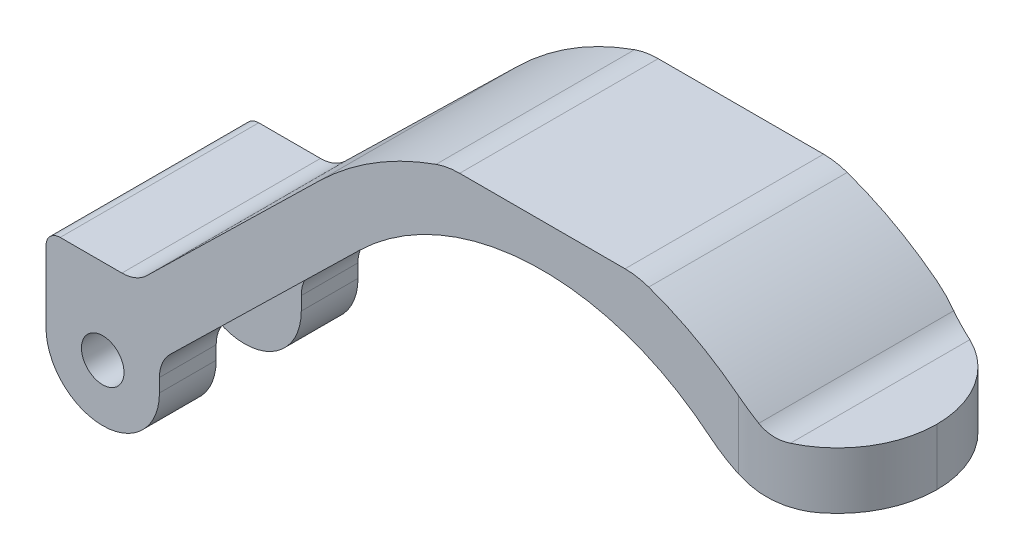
ISO-10303-21;
HEADER;
FILE_DESCRIPTION(('STEP AP214'),'2;1');
FILE_NAME('part.step','',(''),(''),'','','');
FILE_SCHEMA(('AUTOMOTIVE_DESIGN { 1 0 10303 214 1 1 1 1 }'));
ENDSEC;
DATA;
#1=APPLICATION_CONTEXT('core data for automotive mechanical design processes');
#2=APPLICATION_PROTOCOL_DEFINITION('international standard','automotive_design',2000,#1);
#3=PRODUCT_CONTEXT('',#1,'mechanical');
#4=PRODUCT('Part','Part','',(#3));
#5=PRODUCT_RELATED_PRODUCT_CATEGORY('part','',(#4));
#6=PRODUCT_DEFINITION_FORMATION('','',#4);
#7=PRODUCT_DEFINITION_CONTEXT('part definition',#1,'design');
#8=PRODUCT_DEFINITION('design','',#6,#7);
#9=PRODUCT_DEFINITION_SHAPE('','',#8);
#10=(LENGTH_UNIT() NAMED_UNIT(*) SI_UNIT(.MILLI.,.METRE.));
#11=(NAMED_UNIT(*) PLANE_ANGLE_UNIT() SI_UNIT($,.RADIAN.));
#12=(NAMED_UNIT(*) SI_UNIT($,.STERADIAN.) SOLID_ANGLE_UNIT());
#13=UNCERTAINTY_MEASURE_WITH_UNIT(LENGTH_MEASURE(1.E-05),#10,'distance_accuracy_value','');
#14=(GEOMETRIC_REPRESENTATION_CONTEXT(3) GLOBAL_UNCERTAINTY_ASSIGNED_CONTEXT((#13)) GLOBAL_UNIT_ASSIGNED_CONTEXT((#10,
#11,#12)) REPRESENTATION_CONTEXT('',''));
#15=CARTESIAN_POINT('',(0.,0.,0.));
#16=DIRECTION('',(0.,0.,1.));
#17=DIRECTION('',(1.,0.,0.));
#18=AXIS2_PLACEMENT_3D('',#15,#16,#17);
#19=CARTESIAN_POINT('',(0.,0.,28.));
#20=DIRECTION('',(0.,0.,-1.));
#21=DIRECTION('',(-1.,0.,0.));
#22=AXIS2_PLACEMENT_3D('',#19,#20,#21);
#23=CYLINDRICAL_SURFACE('',#22,45.);
#24=CARTESIAN_POINT('',(0.,0.,28.));
#25=DIRECTION('',(0.,0.,1.));
#26=DIRECTION('',(1.,0.,0.));
#27=AXIS2_PLACEMENT_3D('',#24,#25,#26);
#28=CIRCLE('',#27,45.);
#29=CARTESIAN_POINT('',(-14.9938763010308,42.4285714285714,28.));
#30=VERTEX_POINT('',#29);
#31=CARTESIAN_POINT('',(-31.4297251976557,32.2051606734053,28.));
#32=VERTEX_POINT('',#31);
#33=EDGE_CURVE('E262',#30,#32,#28,.T.);
#34=ORIENTED_EDGE('',*,*,#33,.F.);
#35=DIRECTION('',(0.,0.,-1.));
#36=VECTOR('',#35,1.);
#37=CARTESIAN_POINT('',(-14.9938763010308,42.4285714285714,28.));
#38=LINE('',#37,#36);
#39=CARTESIAN_POINT('',(-14.9938763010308,42.4285714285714,0.));
#40=VERTEX_POINT('',#39);
#41=EDGE_CURVE('E11',#30,#40,#38,.T.);
#42=ORIENTED_EDGE('',*,*,#41,.T.);
#43=CARTESIAN_POINT('',(0.,0.,0.));
#44=DIRECTION('',(0.,0.,1.));
#45=DIRECTION('',(1.,0.,0.));
#46=AXIS2_PLACEMENT_3D('',#43,#44,#45);
#47=CIRCLE('',#46,45.);
#48=CARTESIAN_POINT('',(-31.4297251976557,32.2051606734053,0.));
#49=VERTEX_POINT('',#48);
#50=EDGE_CURVE('E285',#40,#49,#47,.T.);
#51=ORIENTED_EDGE('',*,*,#50,.T.);
#52=DIRECTION('',(0.,0.,-1.));
#53=VECTOR('',#52,1.);
#54=CARTESIAN_POINT('',(-31.4297251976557,32.2051606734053,28.));
#55=LINE('',#54,#53);
#56=EDGE_CURVE('E313',#32,#49,#55,.T.);
#57=ORIENTED_EDGE('',*,*,#56,.F.);
#58=EDGE_LOOP('',(#34,#42,#51,#57));
#59=FACE_BOUND('',#58,.T.);
#60=ADVANCED_FACE('F32',(#59),#23,.T.);
#61=CARTESIAN_POINT('',(-62.,-5.,28.));
#62=DIRECTION('',(0.,0.,-1.));
#63=DIRECTION('',(-1.,0.,0.));
#64=AXIS2_PLACEMENT_3D('',#61,#62,#63);
#65=CYLINDRICAL_SURFACE('',#64,8.00000000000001);
#66=DIRECTION('',(0.,0.,-1.));
#67=VECTOR('',#66,1.);
#68=CARTESIAN_POINT('',(-70.,-5.,28.));
#69=LINE('',#68,#67);
#70=CARTESIAN_POINT('',(-70.,-5.,28.));
#71=VERTEX_POINT('',#70);
#72=CARTESIAN_POINT('',(-70.,-4.99999999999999,20.));
#73=VERTEX_POINT('',#72);
#74=EDGE_CURVE('E311',#71,#73,#69,.T.);
#75=ORIENTED_EDGE('',*,*,#74,.T.);
#76=CARTESIAN_POINT('',(-62.,-5.,20.));
#77=DIRECTION('',(0.,0.,1.));
#78=DIRECTION('',(1.,0.,0.));
#79=AXIS2_PLACEMENT_3D('',#76,#77,#78);
#80=CIRCLE('',#79,8.00000000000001);
#81=CARTESIAN_POINT('',(-54.,-5.,20.));
#82=VERTEX_POINT('',#81);
#83=EDGE_CURVE('E236',#73,#82,#80,.T.);
#84=ORIENTED_EDGE('',*,*,#83,.T.);
#85=DIRECTION('',(0.,0.,-1.));
#86=VECTOR('',#85,1.);
#87=CARTESIAN_POINT('',(-54.,-5.,28.));
#88=LINE('',#87,#86);
#89=CARTESIAN_POINT('',(-54.,-5.,28.));
#90=VERTEX_POINT('',#89);
#91=EDGE_CURVE('E307',#90,#82,#88,.T.);
#92=ORIENTED_EDGE('',*,*,#91,.F.);
#93=CARTESIAN_POINT('',(-62.,-5.,28.));
#94=DIRECTION('',(0.,0.,1.));
#95=DIRECTION('',(-1.,0.,0.));
#96=AXIS2_PLACEMENT_3D('',#93,#94,#95);
#97=CIRCLE('',#96,8.00000000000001);
#98=EDGE_CURVE('E275',#71,#90,#97,.T.);
#99=ORIENTED_EDGE('',*,*,#98,.F.);
#100=EDGE_LOOP('',(#75,#84,#92,#99));
#101=FACE_BOUND('',#100,.T.);
#102=ADVANCED_FACE('F601',(#101),#65,.T.);
#103=CARTESIAN_POINT('',(-54.,-0.999999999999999,28.));
#104=DIRECTION('',(-1.,0.,0.));
#105=DIRECTION('',(0.,-1.,0.));
#106=AXIS2_PLACEMENT_3D('',#103,#104,#105);
#107=PLANE('',#106);
#108=DIRECTION('',(0.,1.,0.));
#109=VECTOR('',#108,1.);
#110=CARTESIAN_POINT('',(-54.,-0.999999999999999,0.));
#111=LINE('',#110,#109);
#112=CARTESIAN_POINT('',(-54.,-5.,0.));
#113=VERTEX_POINT('',#112);
#114=CARTESIAN_POINT('',(-54.,-3.1068478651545,0.));
#115=VERTEX_POINT('',#114);
#116=EDGE_CURVE('E300',#113,#115,#111,.T.);
#117=ORIENTED_EDGE('',*,*,#116,.T.);
#118=DIRECTION('',(0.,0.,-1.));
#119=VECTOR('',#118,1.);
#120=CARTESIAN_POINT('',(-54.,-3.1068478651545,8.));
#121=LINE('',#120,#119);
#122=CARTESIAN_POINT('',(-54.,-3.1068478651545,8.));
#123=VERTEX_POINT('',#122);
#124=EDGE_CURVE('E427',#115,#123,#121,.F.);
#125=ORIENTED_EDGE('',*,*,#124,.T.);
#126=DIRECTION('',(0.,-1.,0.));
#127=VECTOR('',#126,1.);
#128=CARTESIAN_POINT('',(-54.,-0.999999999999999,8.));
#129=LINE('',#128,#127);
#130=CARTESIAN_POINT('',(-54.,-5.,8.));
#131=VERTEX_POINT('',#130);
#132=EDGE_CURVE('E254',#123,#131,#129,.T.);
#133=ORIENTED_EDGE('',*,*,#132,.T.);
#134=EDGE_CURVE('E306',#131,#113,#88,.T.);
#135=ORIENTED_EDGE('',*,*,#134,.T.);
#136=EDGE_LOOP('',(#117,#125,#133,#135));
#137=FACE_BOUND('',#136,.T.);
#138=ADVANCED_FACE('F365',(#137),#107,.F.);
#139=CARTESIAN_POINT('',(0.,0.,28.));
#140=DIRECTION('',(0.,0.,-1.));
#141=DIRECTION('',(-1.,0.,0.));
#142=AXIS2_PLACEMENT_3D('',#139,#140,#141);
#143=CYLINDRICAL_SURFACE('',#142,37.);
#144=CARTESIAN_POINT('',(0.,0.,0.));
#145=DIRECTION('',(0.,0.,-1.));
#146=DIRECTION('',(1.,0.,0.));
#147=AXIS2_PLACEMENT_3D('',#144,#145,#146);
#148=CIRCLE('',#147,37.);
#149=CARTESIAN_POINT('',(-25.8422184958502,26.479798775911,0.));
#150=VERTEX_POINT('',#149);
#151=CARTESIAN_POINT('',(23.5211868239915,28.5614035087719,0.));
#152=VERTEX_POINT('',#151);
#153=EDGE_CURVE('E258',#150,#152,#148,.T.);
#154=ORIENTED_EDGE('',*,*,#153,.T.);
#155=DIRECTION('',(0.,0.,-1.));
#156=VECTOR('',#155,1.);
#157=CARTESIAN_POINT('',(23.5211868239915,28.5614035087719,28.));
#158=LINE('',#157,#156);
#159=CARTESIAN_POINT('',(23.5211868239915,28.5614035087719,28.));
#160=VERTEX_POINT('',#159);
#161=EDGE_CURVE('E536',#152,#160,#158,.F.);
#162=ORIENTED_EDGE('',*,*,#161,.T.);
#163=CARTESIAN_POINT('',(0.,0.,28.));
#164=DIRECTION('',(0.,0.,-1.));
#165=DIRECTION('',(1.,0.,0.));
#166=AXIS2_PLACEMENT_3D('',#163,#164,#165);
#167=CIRCLE('',#166,37.);
#168=CARTESIAN_POINT('',(-25.8422184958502,26.479798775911,28.));
#169=VERTEX_POINT('',#168);
#170=EDGE_CURVE('E259',#169,#160,#167,.T.);
#171=ORIENTED_EDGE('',*,*,#170,.F.);
#172=DIRECTION('',(0.,0.,-1.));
#173=VECTOR('',#172,1.);
#174=CARTESIAN_POINT('',(-25.8422184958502,26.479798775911,28.));
#175=LINE('',#174,#173);
#176=EDGE_CURVE('E282',#169,#150,#175,.T.);
#177=ORIENTED_EDGE('',*,*,#176,.T.);
#178=EDGE_LOOP('',(#154,#162,#171,#177));
#179=FACE_BOUND('',#178,.T.);
#180=ADVANCED_FACE('F362',(#179),#143,.F.);
#181=CARTESIAN_POINT('',(28.1602556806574,24.,28.));
#182=DIRECTION('',(0.,1.,0.));
#183=DIRECTION('',(0.,0.,1.));
#184=AXIS2_PLACEMENT_3D('',#181,#182,#183);
#185=PLANE('',#184);
#186=CARTESIAN_POINT('',(27.6385840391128,24.,14.));
#187=DIRECTION('',(0.,1.,0.));
#188=DIRECTION('',(0.,0.,1.));
#189=AXIS2_PLACEMENT_3D('',#186,#187,#188);
#190=CIRCLE('',#189,14.);
#191=CARTESIAN_POINT('',(41.6385840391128,24.,14.));
#192=VERTEX_POINT('',#191);
#193=CARTESIAN_POINT('',(36.2353418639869,24.,25.0496947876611));
#194=VERTEX_POINT('',#193);
#195=EDGE_CURVE('E550',#192,#194,#190,.F.);
#196=ORIENTED_EDGE('',*,*,#195,.T.);
#197=DIRECTION('',(0.,0.,-1.));
#198=VECTOR('',#197,1.);
#199=CARTESIAN_POINT('',(36.2353418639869,24.,28.));
#200=LINE('',#199,#198);
#201=CARTESIAN_POINT('',(36.2353418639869,24.,2.9503052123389));
#202=VERTEX_POINT('',#201);
#203=EDGE_CURVE('E384',#194,#202,#200,.T.);
#204=ORIENTED_EDGE('',*,*,#203,.T.);
#205=CARTESIAN_POINT('',(27.6385840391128,24.,14.));
#206=DIRECTION('',(0.,1.,0.));
#207=DIRECTION('',(0.,0.,1.));
#208=AXIS2_PLACEMENT_3D('',#205,#206,#207);
#209=CIRCLE('',#208,14.);
#210=EDGE_CURVE('E547',#202,#192,#209,.F.);
#211=ORIENTED_EDGE('',*,*,#210,.T.);
#212=EDGE_LOOP('',(#196,#204,#211));
#213=FACE_BOUND('',#212,.T.);
#214=ADVANCED_FACE('F358',(#213),#185,.F.);
#215=CARTESIAN_POINT('',(41.6385840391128,32.,28.));
#216=DIRECTION('',(0.,-1.,0.));
#217=DIRECTION('',(0.,0.,-1.));
#218=AXIS2_PLACEMENT_3D('',#215,#216,#217);
#219=PLANE('',#218);
#220=CARTESIAN_POINT('',(27.6385840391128,32.,14.));
#221=DIRECTION('',(0.,-1.,0.));
#222=DIRECTION('',(0.,0.,-1.));
#223=AXIS2_PLACEMENT_3D('',#220,#221,#222);
#224=CIRCLE('',#223,14.);
#225=CARTESIAN_POINT('',(41.6385840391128,32.,14.));
#226=VERTEX_POINT('',#225);
#227=CARTESIAN_POINT('',(33.6303434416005,32.,1.34698378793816));
#228=VERTEX_POINT('',#227);
#229=EDGE_CURVE('E557',#226,#228,#224,.F.);
#230=ORIENTED_EDGE('',*,*,#229,.T.);
#231=DIRECTION('',(0.,0.,1.));
#232=VECTOR('',#231,1.);
#233=CARTESIAN_POINT('',(33.6303434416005,32.,27.4164078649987));
#234=LINE('',#233,#232);
#235=CARTESIAN_POINT('',(33.6303434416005,32.,26.6530162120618));
#236=VERTEX_POINT('',#235);
#237=EDGE_CURVE('E569',#228,#236,#234,.T.);
#238=ORIENTED_EDGE('',*,*,#237,.T.);
#239=CARTESIAN_POINT('',(27.6385840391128,32.,14.));
#240=DIRECTION('',(0.,-1.,0.));
#241=DIRECTION('',(0.,0.,-1.));
#242=AXIS2_PLACEMENT_3D('',#239,#240,#241);
#243=CIRCLE('',#242,14.);
#244=EDGE_CURVE('E553',#236,#226,#243,.F.);
#245=ORIENTED_EDGE('',*,*,#244,.T.);
#246=EDGE_LOOP('',(#230,#238,#245));
#247=FACE_BOUND('',#246,.T.);
#248=ADVANCED_FACE('F352',(#247),#219,.F.);
#249=CARTESIAN_POINT('',(27.6385840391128,35.5120919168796,0.));
#250=VERTEX_POINT('',#249);
#251=CARTESIAN_POINT('',(14.9938763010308,42.4285714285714,0.));
#252=VERTEX_POINT('',#251);
#253=EDGE_CURVE('E286',#250,#252,#47,.T.);
#254=ORIENTED_EDGE('',*,*,#253,.T.);
#255=DIRECTION('',(0.,0.,-1.));
#256=VECTOR('',#255,1.);
#257=CARTESIAN_POINT('',(14.9938763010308,42.4285714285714,28.));
#258=LINE('',#257,#256);
#259=CARTESIAN_POINT('',(14.9938763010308,42.4285714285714,28.));
#260=VERTEX_POINT('',#259);
#261=EDGE_CURVE('E456',#252,#260,#258,.F.);
#262=ORIENTED_EDGE('',*,*,#261,.T.);
#263=CARTESIAN_POINT('',(27.6385840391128,35.5120919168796,28.));
#264=VERTEX_POINT('',#263);
#265=EDGE_CURVE('E264',#264,#260,#28,.T.);
#266=ORIENTED_EDGE('',*,*,#265,.F.);
#267=CARTESIAN_POINT('',(27.6385840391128,35.5120919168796,28.));
#268=CARTESIAN_POINT('',(27.9923030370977,35.2368316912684,27.9999872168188));
#269=CARTESIAN_POINT('',(28.341791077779,34.9563108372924,27.9865977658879));
#270=CARTESIAN_POINT('',(29.0299393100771,34.3869264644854,27.9349496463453));
#271=CARTESIAN_POINT('',(29.3686336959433,34.0980962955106,27.8967799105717));
#272=CARTESIAN_POINT('',(30.0353376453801,33.512318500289,27.7974341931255));
#273=CARTESIAN_POINT('',(30.3633482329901,33.2153716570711,27.7362604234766));
#274=CARTESIAN_POINT('',(31.0091565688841,32.6133125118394,27.5922388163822));
#275=CARTESIAN_POINT('',(31.3269135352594,32.3081747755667,27.5093141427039));
#276=CARTESIAN_POINT('',(31.6385840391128,32.,27.4164078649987));
#277=B_SPLINE_CURVE_WITH_KNOTS('',3,(#267,#268,#269,#270,#271,#272,#273,#274,#275,#276),
.UNSPECIFIED.,.F.,.F.,(4,2,2,2,4),(0.,1.34420238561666,2.6836070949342,4.02288304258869,
5.36695530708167),.UNSPECIFIED.);
#278=CARTESIAN_POINT('',(30.2673090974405,33.2999999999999,27.7509928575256));
#279=VERTEX_POINT('',#278);
#280=EDGE_CURVE('E336',#264,#279,#277,.T.);
#281=ORIENTED_EDGE('',*,*,#280,.T.);
#282=DIRECTION('',(0.,0.,-1.));
#283=VECTOR('',#282,1.);
#284=CARTESIAN_POINT('',(30.2673090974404,33.3,28.));
#285=LINE('',#284,#283);
#286=CARTESIAN_POINT('',(30.2673090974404,33.3,0.2490071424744));
#287=VERTEX_POINT('',#286);
#288=EDGE_CURVE('E567',#279,#287,#285,.T.);
#289=ORIENTED_EDGE('',*,*,#288,.T.);
#290=CARTESIAN_POINT('',(31.6385840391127,32.,0.583592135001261));
#291=CARTESIAN_POINT('',(31.3269135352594,32.3081747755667,0.490685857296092));
#292=CARTESIAN_POINT('',(31.0091565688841,32.6133125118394,0.40776118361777));
#293=CARTESIAN_POINT('',(30.3633482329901,33.2153716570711,0.263739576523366));
#294=CARTESIAN_POINT('',(30.0353376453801,33.512318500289,0.202565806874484));
#295=CARTESIAN_POINT('',(29.3686336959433,34.0980962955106,0.103220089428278));
#296=CARTESIAN_POINT('',(29.0299393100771,34.3869264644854,0.0650503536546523));
#297=CARTESIAN_POINT('',(28.341791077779,34.9563108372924,0.0134022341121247));
#298=CARTESIAN_POINT('',(27.9923030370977,35.2368316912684,1.27831812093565E-05));
#299=CARTESIAN_POINT('',(27.6385840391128,35.5120919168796,0.));
#300=B_SPLINE_CURVE_WITH_KNOTS('',3,(#290,#291,#292,#293,#294,#295,#296,#297,#298,#299),
.UNSPECIFIED.,.F.,.F.,(4,2,2,2,4),(0.,1.34407226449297,2.68334821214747,4.022752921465,
5.36695530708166),.UNSPECIFIED.);
#301=EDGE_CURVE('E328',#287,#250,#300,.T.);
#302=ORIENTED_EDGE('',*,*,#301,.T.);
#303=EDGE_LOOP('',(#254,#262,#266,#281,#289,#302));
#304=FACE_BOUND('',#303,.T.);
#305=ADVANCED_FACE('F346',(#304),#23,.T.);
#306=CARTESIAN_POINT('',(-57.256748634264,7.,28.));
#307=DIRECTION('',(0.698438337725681,-0.715670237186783,0.));
#308=DIRECTION('',(0.715670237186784,0.698438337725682,0.));
#309=AXIS2_PLACEMENT_3D('',#306,#307,#308);
#310=PLANE('',#309);
#311=DIRECTION('',(-0.715670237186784,-0.698438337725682,0.));
#312=VECTOR('',#311,1.);
#313=CARTESIAN_POINT('',(-57.256748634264,7.,0.));
#314=LINE('',#313,#312);
#315=CARTESIAN_POINT('',(-55.8000248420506,8.42164881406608,0.));
#316=VERTEX_POINT('',#315);
#317=EDGE_CURVE('E289',#49,#316,#314,.T.);
#318=ORIENTED_EDGE('',*,*,#317,.T.);
#319=DIRECTION('',(0.,0.,-1.));
#320=VECTOR('',#319,1.);
#321=CARTESIAN_POINT('',(-55.8000248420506,8.42164881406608,28.));
#322=LINE('',#321,#320);
#323=CARTESIAN_POINT('',(-55.8000248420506,8.42164881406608,28.));
#324=VERTEX_POINT('',#323);
#325=EDGE_CURVE('E565',#316,#324,#322,.F.);
#326=ORIENTED_EDGE('',*,*,#325,.T.);
#327=DIRECTION('',(-0.715670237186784,-0.698438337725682,0.));
#328=VECTOR('',#327,1.);
#329=CARTESIAN_POINT('',(-57.256748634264,7.,28.));
#330=LINE('',#329,#328);
#331=EDGE_CURVE('E267',#32,#324,#330,.T.);
#332=ORIENTED_EDGE('',*,*,#331,.F.);
#333=ORIENTED_EDGE('',*,*,#56,.T.);
#334=EDGE_LOOP('',(#318,#326,#332,#333));
#335=FACE_BOUND('',#334,.T.);
#336=ADVANCED_FACE('F351',(#335),#310,.F.);
#337=CARTESIAN_POINT('',(-70.,7.,28.));
#338=DIRECTION('',(0.,-1.,0.));
#339=DIRECTION('',(0.,0.,-1.));
#340=AXIS2_PLACEMENT_3D('',#337,#338,#339);
#341=PLANE('',#340);
#342=DIRECTION('',(-1.,0.,0.));
#343=VECTOR('',#342,1.);
#344=CARTESIAN_POINT('',(-70.,7.,0.));
#345=LINE('',#344,#343);
#346=CARTESIAN_POINT('',(-59.292216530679,7.,0.));
#347=VERTEX_POINT('',#346);
#348=CARTESIAN_POINT('',(-68.,7.,0.));
#349=VERTEX_POINT('',#348);
#350=EDGE_CURVE('E292',#347,#349,#345,.T.);
#351=ORIENTED_EDGE('',*,*,#350,.T.);
#352=DIRECTION('',(0.,0.,-1.));
#353=VECTOR('',#352,1.);
#354=CARTESIAN_POINT('',(-68.,7.,28.));
#355=LINE('',#354,#353);
#356=CARTESIAN_POINT('',(-68.,7.,28.));
#357=VERTEX_POINT('',#356);
#358=EDGE_CURVE('E444',#349,#357,#355,.F.);
#359=ORIENTED_EDGE('',*,*,#358,.T.);
#360=DIRECTION('',(-1.,0.,0.));
#361=VECTOR('',#360,1.);
#362=CARTESIAN_POINT('',(-70.,7.,28.));
#363=LINE('',#362,#361);
#364=CARTESIAN_POINT('',(-59.292216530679,7.,28.));
#365=VERTEX_POINT('',#364);
#366=EDGE_CURVE('E270',#365,#357,#363,.T.);
#367=ORIENTED_EDGE('',*,*,#366,.F.);
#368=DIRECTION('',(0.,0.,-1.));
#369=VECTOR('',#368,1.);
#370=CARTESIAN_POINT('',(-59.292216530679,7.,0.));
#371=LINE('',#370,#369);
#372=EDGE_CURVE('E561',#365,#347,#371,.T.);
#373=ORIENTED_EDGE('',*,*,#372,.T.);
#374=EDGE_LOOP('',(#351,#359,#367,#373));
#375=FACE_BOUND('',#374,.T.);
#376=ADVANCED_FACE('F588',(#375),#341,.F.);
#377=CARTESIAN_POINT('',(-70.,-5.,28.));
#378=DIRECTION('',(1.,0.,0.));
#379=DIRECTION('',(0.,1.,0.));
#380=AXIS2_PLACEMENT_3D('',#377,#378,#379);
#381=PLANE('',#380);
#382=DIRECTION('',(0.,-1.,0.));
#383=VECTOR('',#382,1.);
#384=CARTESIAN_POINT('',(-70.,-5.,28.));
#385=LINE('',#384,#383);
#386=CARTESIAN_POINT('',(-70.,5.,28.));
#387=VERTEX_POINT('',#386);
#388=EDGE_CURVE('E273',#387,#71,#385,.T.);
#389=ORIENTED_EDGE('',*,*,#388,.F.);
#390=DIRECTION('',(0.,0.,-1.));
#391=VECTOR('',#390,1.);
#392=CARTESIAN_POINT('',(-70.,5.,28.));
#393=LINE('',#392,#391);
#394=CARTESIAN_POINT('',(-70.,5.,0.));
#395=VERTEX_POINT('',#394);
#396=EDGE_CURVE('E439',#387,#395,#393,.T.);
#397=ORIENTED_EDGE('',*,*,#396,.T.);
#398=DIRECTION('',(0.,-1.,0.));
#399=VECTOR('',#398,1.);
#400=CARTESIAN_POINT('',(-70.,-5.,0.));
#401=LINE('',#400,#399);
#402=CARTESIAN_POINT('',(-70.,-5.,0.));
#403=VERTEX_POINT('',#402);
#404=EDGE_CURVE('E295',#395,#403,#401,.T.);
#405=ORIENTED_EDGE('',*,*,#404,.T.);
#406=CARTESIAN_POINT('',(-70.,-4.99999999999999,8.));
#407=VERTEX_POINT('',#406);
#408=EDGE_CURVE('E310',#407,#403,#69,.T.);
#409=ORIENTED_EDGE('',*,*,#408,.F.);
#410=DIRECTION('',(0.,-1.,0.));
#411=VECTOR('',#410,1.);
#412=CARTESIAN_POINT('',(-70.,-13.,8.));
#413=LINE('',#412,#411);
#414=CARTESIAN_POINT('',(-70.,3.00000000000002,8.));
#415=VERTEX_POINT('',#414);
#416=EDGE_CURVE('E240',#415,#407,#413,.T.);
#417=ORIENTED_EDGE('',*,*,#416,.F.);
#418=DIRECTION('',(0.,0.,-1.));
#419=VECTOR('',#418,1.);
#420=CARTESIAN_POINT('',(-70.,3.00000000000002,8.));
#421=LINE('',#420,#419);
#422=CARTESIAN_POINT('',(-70.,3.00000000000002,20.));
#423=VERTEX_POINT('',#422);
#424=EDGE_CURVE('E223',#423,#415,#421,.T.);
#425=ORIENTED_EDGE('',*,*,#424,.F.);
#426=DIRECTION('',(0.,1.,0.));
#427=VECTOR('',#426,1.);
#428=CARTESIAN_POINT('',(-70.,-13.,20.));
#429=LINE('',#428,#427);
#430=EDGE_CURVE('E233',#73,#423,#429,.T.);
#431=ORIENTED_EDGE('',*,*,#430,.F.);
#432=ORIENTED_EDGE('',*,*,#74,.F.);
#433=EDGE_LOOP('',(#389,#397,#405,#409,#417,#425,#431,#432));
#434=FACE_BOUND('',#433,.T.);
#435=ADVANCED_FACE('F243',(#434),#381,.F.);
#436=ORIENTED_EDGE('',*,*,#134,.F.);
#437=CARTESIAN_POINT('',(-62.,-5.,8.));
#438=DIRECTION('',(0.,0.,-1.));
#439=DIRECTION('',(-1.,0.,0.));
#440=AXIS2_PLACEMENT_3D('',#437,#438,#439);
#441=CIRCLE('',#440,8.00000000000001);
#442=EDGE_CURVE('E256',#131,#407,#441,.T.);
#443=ORIENTED_EDGE('',*,*,#442,.T.);
#444=ORIENTED_EDGE('',*,*,#408,.T.);
#445=CARTESIAN_POINT('',(-62.,-5.,0.));
#446=DIRECTION('',(0.,0.,1.));
#447=DIRECTION('',(-1.,0.,0.));
#448=AXIS2_PLACEMENT_3D('',#445,#446,#447);
#449=CIRCLE('',#448,8.00000000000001);
#450=EDGE_CURVE('E297',#403,#113,#449,.T.);
#451=ORIENTED_EDGE('',*,*,#450,.T.);
#452=EDGE_LOOP('',(#436,#443,#444,#451));
#453=FACE_BOUND('',#452,.T.);
#454=ADVANCED_FACE('F507',(#453),#65,.T.);
#455=DIRECTION('',(0.,1.,0.));
#456=VECTOR('',#455,1.);
#457=CARTESIAN_POINT('',(-54.,-0.999999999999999,20.));
#458=LINE('',#457,#456);
#459=CARTESIAN_POINT('',(-54.,-3.1068478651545,20.));
#460=VERTEX_POINT('',#459);
#461=EDGE_CURVE('E249',#82,#460,#458,.T.);
#462=ORIENTED_EDGE('',*,*,#461,.T.);
#463=DIRECTION('',(0.,0.,-1.));
#464=VECTOR('',#463,1.);
#465=CARTESIAN_POINT('',(-54.,-3.1068478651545,28.));
#466=LINE('',#465,#464);
#467=CARTESIAN_POINT('',(-54.,-3.1068478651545,28.));
#468=VERTEX_POINT('',#467);
#469=EDGE_CURVE('E429',#460,#468,#466,.F.);
#470=ORIENTED_EDGE('',*,*,#469,.T.);
#471=DIRECTION('',(0.,1.,0.));
#472=VECTOR('',#471,1.);
#473=CARTESIAN_POINT('',(-54.,-0.999999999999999,28.));
#474=LINE('',#473,#472);
#475=EDGE_CURVE('E277',#90,#468,#474,.T.);
#476=ORIENTED_EDGE('',*,*,#475,.F.);
#477=ORIENTED_EDGE('',*,*,#91,.T.);
#478=EDGE_LOOP('',(#462,#470,#476,#477));
#479=FACE_BOUND('',#478,.T.);
#480=ADVANCED_FACE('F526',(#479),#107,.F.);
#481=CARTESIAN_POINT('',(-25.8422184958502,26.479798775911,28.));
#482=DIRECTION('',(-0.698438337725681,0.715670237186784,0.));
#483=DIRECTION('',(-0.715670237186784,-0.698438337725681,0.));
#484=AXIS2_PLACEMENT_3D('',#481,#482,#483);
#485=PLANE('',#484);
#486=DIRECTION('',(0.,0.,-1.));
#487=VECTOR('',#486,1.);
#488=CARTESIAN_POINT('',(-49.3186223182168,3.56865952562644,28.));
#489=LINE('',#488,#487);
#490=CARTESIAN_POINT('',(-49.3186223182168,3.56865952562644,20.));
#491=VERTEX_POINT('',#490);
#492=CARTESIAN_POINT('',(-49.3186223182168,3.56865952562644,8.));
#493=VERTEX_POINT('',#492);
#494=EDGE_CURVE('E448',#491,#493,#489,.T.);
#495=ORIENTED_EDGE('',*,*,#494,.T.);
#496=DIRECTION('',(-0.715670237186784,-0.698438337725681,0.));
#497=VECTOR('',#496,1.);
#498=CARTESIAN_POINT('',(-25.8422184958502,26.479798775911,8.));
#499=LINE('',#498,#497);
#500=CARTESIAN_POINT('',(-52.4921916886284,0.471503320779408,8.));
#501=VERTEX_POINT('',#500);
#502=EDGE_CURVE('E318',#493,#501,#499,.T.);
#503=ORIENTED_EDGE('',*,*,#502,.T.);
#504=DIRECTION('',(0.,0.,-1.));
#505=VECTOR('',#504,1.);
#506=CARTESIAN_POINT('',(-52.4921916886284,0.471503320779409,0.));
#507=LINE('',#506,#505);
#508=CARTESIAN_POINT('',(-52.4921916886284,0.471503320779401,0.));
#509=VERTEX_POINT('',#508);
#510=EDGE_CURVE('E424',#501,#509,#507,.T.);
#511=ORIENTED_EDGE('',*,*,#510,.T.);
#512=DIRECTION('',(0.715670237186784,0.698438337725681,0.));
#513=VECTOR('',#512,1.);
#514=CARTESIAN_POINT('',(-25.8422184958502,26.479798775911,0.));
#515=LINE('',#514,#513);
#516=EDGE_CURVE('E263',#509,#150,#515,.T.);
#517=ORIENTED_EDGE('',*,*,#516,.T.);
#518=ORIENTED_EDGE('',*,*,#176,.F.);
#519=DIRECTION('',(0.715670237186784,0.698438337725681,0.));
#520=VECTOR('',#519,1.);
#521=CARTESIAN_POINT('',(-25.8422184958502,26.479798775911,28.));
#522=LINE('',#521,#520);
#523=CARTESIAN_POINT('',(-52.4921916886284,0.471503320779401,28.));
#524=VERTEX_POINT('',#523);
#525=EDGE_CURVE('E280',#524,#169,#522,.T.);
#526=ORIENTED_EDGE('',*,*,#525,.F.);
#527=DIRECTION('',(0.,0.,-1.));
#528=VECTOR('',#527,1.);
#529=CARTESIAN_POINT('',(-52.4921916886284,0.471503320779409,20.));
#530=LINE('',#529,#528);
#531=CARTESIAN_POINT('',(-52.4921916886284,0.471503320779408,20.));
#532=VERTEX_POINT('',#531);
#533=EDGE_CURVE('E419',#524,#532,#530,.T.);
#534=ORIENTED_EDGE('',*,*,#533,.T.);
#535=DIRECTION('',(0.715670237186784,0.698438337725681,0.));
#536=VECTOR('',#535,1.);
#537=CARTESIAN_POINT('',(-25.8422184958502,26.479798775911,20.));
#538=LINE('',#537,#536);
#539=EDGE_CURVE('E316',#532,#491,#538,.T.);
#540=ORIENTED_EDGE('',*,*,#539,.T.);
#541=EDGE_LOOP('',(#495,#503,#511,#517,#518,#526,#534,#540));
#542=FACE_BOUND('',#541,.T.);
#543=ADVANCED_FACE('F517',(#542),#485,.F.);
#544=CARTESIAN_POINT('',(0.,0.,28.));
#545=DIRECTION('',(0.,0.,1.));
#546=DIRECTION('',(1.,0.,0.));
#547=AXIS2_PLACEMENT_3D('',#544,#545,#546);
#548=PLANE('',#547);
#549=ORIENTED_EDGE('',*,*,#265,.T.);
#550=CARTESIAN_POINT('',(11.6619037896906,33.,28.));
#551=DIRECTION('',(0.,0.,1.));
#552=DIRECTION('',(1.,0.,0.));
#553=AXIS2_PLACEMENT_3D('',#550,#551,#552);
#554=CIRCLE('',#553,10.);
#555=CARTESIAN_POINT('',(11.6619037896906,43.,28.));
#556=VERTEX_POINT('',#555);
#557=EDGE_CURVE('E461',#260,#556,#554,.T.);
#558=ORIENTED_EDGE('',*,*,#557,.T.);
#559=DIRECTION('',(1.,0.,0.));
#560=VECTOR('',#559,1.);
#561=CARTESIAN_POINT('',(-13.2664991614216,43.,28.));
#562=LINE('',#561,#560);
#563=CARTESIAN_POINT('',(-11.6619037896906,43.,28.));
#564=VERTEX_POINT('',#563);
#565=EDGE_CURVE('E485',#564,#556,#562,.T.);
#566=ORIENTED_EDGE('',*,*,#565,.F.);
#567=CARTESIAN_POINT('',(-11.6619037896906,33.,28.));
#568=DIRECTION('',(0.,0.,1.));
#569=DIRECTION('',(1.,0.,0.));
#570=AXIS2_PLACEMENT_3D('',#567,#568,#569);
#571=CIRCLE('',#570,10.);
#572=EDGE_CURVE('E459',#564,#30,#571,.T.);
#573=ORIENTED_EDGE('',*,*,#572,.T.);
#574=ORIENTED_EDGE('',*,*,#33,.T.);
#575=ORIENTED_EDGE('',*,*,#331,.T.);
#576=CARTESIAN_POINT('',(-59.292216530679,12.,28.));
#577=DIRECTION('',(0.,0.,1.));
#578=DIRECTION('',(1.,0.,0.));
#579=AXIS2_PLACEMENT_3D('',#576,#577,#578);
#580=CIRCLE('',#579,5.);
#581=EDGE_CURVE('E572',#324,#365,#580,.F.);
#582=ORIENTED_EDGE('',*,*,#581,.T.);
#583=ORIENTED_EDGE('',*,*,#366,.T.);
#584=CARTESIAN_POINT('',(-68.,5.,28.));
#585=DIRECTION('',(0.,0.,1.));
#586=DIRECTION('',(1.,0.,0.));
#587=AXIS2_PLACEMENT_3D('',#584,#585,#586);
#588=CIRCLE('',#587,2.);
#589=EDGE_CURVE('E446',#357,#387,#588,.T.);
#590=ORIENTED_EDGE('',*,*,#589,.T.);
#591=ORIENTED_EDGE('',*,*,#388,.T.);
#592=ORIENTED_EDGE('',*,*,#98,.T.);
#593=ORIENTED_EDGE('',*,*,#475,.T.);
#594=CARTESIAN_POINT('',(-49.,-3.10684786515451,28.));
#595=DIRECTION('',(0.,0.,1.));
#596=DIRECTION('',(1.,0.,0.));
#597=AXIS2_PLACEMENT_3D('',#594,#595,#596);
#598=CIRCLE('',#597,5.);
#599=EDGE_CURVE('E437',#468,#524,#598,.F.);
#600=ORIENTED_EDGE('',*,*,#599,.T.);
#601=ORIENTED_EDGE('',*,*,#525,.T.);
#602=ORIENTED_EDGE('',*,*,#170,.T.);
#603=CARTESIAN_POINT('',(36.2353418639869,44.,28.));
#604=DIRECTION('',(0.,0.,1.));
#605=DIRECTION('',(1.,0.,0.));
#606=AXIS2_PLACEMENT_3D('',#603,#604,#605);
#607=CIRCLE('',#606,20.);
#608=CARTESIAN_POINT('',(27.6385840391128,25.9418784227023,28.));
#609=VERTEX_POINT('',#608);
#610=EDGE_CURVE('E420',#160,#609,#607,.T.);
#611=ORIENTED_EDGE('',*,*,#610,.T.);
#612=DIRECTION('',(0.,1.,0.));
#613=VECTOR('',#612,1.);
#614=CARTESIAN_POINT('',(27.6385840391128,32.,28.));
#615=LINE('',#614,#613);
#616=EDGE_CURVE('E321',#609,#264,#615,.T.);
#617=ORIENTED_EDGE('',*,*,#616,.T.);
#618=EDGE_LOOP('',(#549,#558,#566,#573,#574,#575,#582,#583,#590,#591,#592,#593,#600,#601,#602,
#611,#617));
#619=FACE_BOUND('',#618,.T.);
#620=CARTESIAN_POINT('',(-62.,-5.,28.));
#621=DIRECTION('',(0.,0.,1.));
#622=DIRECTION('',(1.,0.,0.));
#623=AXIS2_PLACEMENT_3D('',#620,#621,#622);
#624=CIRCLE('',#623,3.);
#625=CARTESIAN_POINT('',(-59.,-5.,28.));
#626=VERTEX_POINT('',#625);
#627=EDGE_CURVE('E494',#626,#626,#624,.T.);
#628=ORIENTED_EDGE('',*,*,#627,.F.);
#629=EDGE_LOOP('',(#628));
#630=FACE_BOUND('',#629,.T.);
#631=ADVANCED_FACE('F483',(#619,#630),#548,.T.);
#632=CARTESIAN_POINT('',(0.,0.,0.));
#633=DIRECTION('',(0.,0.,1.));
#634=DIRECTION('',(1.,0.,0.));
#635=AXIS2_PLACEMENT_3D('',#632,#633,#634);
#636=PLANE('',#635);
#637=CARTESIAN_POINT('',(-62.,-5.,0.));
#638=DIRECTION('',(0.,0.,1.));
#639=DIRECTION('',(1.,0.,0.));
#640=AXIS2_PLACEMENT_3D('',#637,#638,#639);
#641=CIRCLE('',#640,3.);
#642=CARTESIAN_POINT('',(-59.,-5.,0.));
#643=VERTEX_POINT('',#642);
#644=EDGE_CURVE('E326',#643,#643,#641,.T.);
#645=ORIENTED_EDGE('',*,*,#644,.T.);
#646=EDGE_LOOP('',(#645));
#647=FACE_BOUND('',#646,.T.);
#648=DIRECTION('',(1.,0.,0.));
#649=VECTOR('',#648,1.);
#650=CARTESIAN_POINT('',(-13.2664991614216,43.,0.));
#651=LINE('',#650,#649);
#652=CARTESIAN_POINT('',(-11.6619037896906,43.,0.));
#653=VERTEX_POINT('',#652);
#654=CARTESIAN_POINT('',(11.6619037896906,43.,0.));
#655=VERTEX_POINT('',#654);
#656=EDGE_CURVE('E474',#653,#655,#651,.T.);
#657=ORIENTED_EDGE('',*,*,#656,.T.);
#658=CARTESIAN_POINT('',(11.6619037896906,33.,0.));
#659=DIRECTION('',(0.,0.,1.));
#660=DIRECTION('',(1.,0.,0.));
#661=AXIS2_PLACEMENT_3D('',#658,#659,#660);
#662=CIRCLE('',#661,10.);
#663=EDGE_CURVE('E40',#655,#252,#662,.F.);
#664=ORIENTED_EDGE('',*,*,#663,.T.);
#665=ORIENTED_EDGE('',*,*,#253,.F.);
#666=DIRECTION('',(0.,1.,0.));
#667=VECTOR('',#666,1.);
#668=CARTESIAN_POINT('',(27.6385840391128,0.,0.));
#669=LINE('',#668,#667);
#670=CARTESIAN_POINT('',(27.6385840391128,25.9418784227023,0.));
#671=VERTEX_POINT('',#670);
#672=EDGE_CURVE('E555',#250,#671,#669,.F.);
#673=ORIENTED_EDGE('',*,*,#672,.T.);
#674=CARTESIAN_POINT('',(36.2353418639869,44.,0.));
#675=DIRECTION('',(0.,0.,1.));
#676=DIRECTION('',(1.,0.,0.));
#677=AXIS2_PLACEMENT_3D('',#674,#675,#676);
#678=CIRCLE('',#677,20.);
#679=EDGE_CURVE('E542',#671,#152,#678,.F.);
#680=ORIENTED_EDGE('',*,*,#679,.T.);
#681=ORIENTED_EDGE('',*,*,#153,.F.);
#682=ORIENTED_EDGE('',*,*,#516,.F.);
#683=CARTESIAN_POINT('',(-49.,-3.10684786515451,0.));
#684=DIRECTION('',(0.,0.,1.));
#685=DIRECTION('',(1.,0.,0.));
#686=AXIS2_PLACEMENT_3D('',#683,#684,#685);
#687=CIRCLE('',#686,5.);
#688=EDGE_CURVE('E431',#509,#115,#687,.T.);
#689=ORIENTED_EDGE('',*,*,#688,.T.);
#690=ORIENTED_EDGE('',*,*,#116,.F.);
#691=ORIENTED_EDGE('',*,*,#450,.F.);
#692=ORIENTED_EDGE('',*,*,#404,.F.);
#693=CARTESIAN_POINT('',(-68.,5.,0.));
#694=DIRECTION('',(0.,0.,1.));
#695=DIRECTION('',(1.,0.,0.));
#696=AXIS2_PLACEMENT_3D('',#693,#694,#695);
#697=CIRCLE('',#696,2.);
#698=EDGE_CURVE('E442',#395,#349,#697,.F.);
#699=ORIENTED_EDGE('',*,*,#698,.T.);
#700=ORIENTED_EDGE('',*,*,#350,.F.);
#701=CARTESIAN_POINT('',(-59.292216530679,12.,0.));
#702=DIRECTION('',(0.,0.,1.));
#703=DIRECTION('',(1.,0.,0.));
#704=AXIS2_PLACEMENT_3D('',#701,#702,#703);
#705=CIRCLE('',#704,5.);
#706=EDGE_CURVE('E571',#347,#316,#705,.T.);
#707=ORIENTED_EDGE('',*,*,#706,.T.);
#708=ORIENTED_EDGE('',*,*,#317,.F.);
#709=ORIENTED_EDGE('',*,*,#50,.F.);
#710=CARTESIAN_POINT('',(-11.6619037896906,33.,0.));
#711=DIRECTION('',(0.,0.,1.));
#712=DIRECTION('',(1.,0.,0.));
#713=AXIS2_PLACEMENT_3D('',#710,#711,#712);
#714=CIRCLE('',#713,10.);
#715=EDGE_CURVE('E467',#40,#653,#714,.F.);
#716=ORIENTED_EDGE('',*,*,#715,.T.);
#717=EDGE_LOOP('',(#657,#664,#665,#673,#680,#681,#682,#689,#690,#691,#692,#699,#700,#707,#708,
#709,#716));
#718=FACE_BOUND('',#717,.T.);
#719=ADVANCED_FACE('F471',(#647,#718),#636,.F.);
#720=CARTESIAN_POINT('',(-42.,-13.,8.));
#721=DIRECTION('',(0.,0.,-1.));
#722=DIRECTION('',(-1.,0.,0.));
#723=AXIS2_PLACEMENT_3D('',#720,#721,#722);
#724=PLANE('',#723);
#725=CARTESIAN_POINT('',(-62.,-5.,8.));
#726=DIRECTION('',(0.,0.,-1.));
#727=DIRECTION('',(-1.,0.,0.));
#728=AXIS2_PLACEMENT_3D('',#725,#726,#727);
#729=CIRCLE('',#728,3.);
#730=CARTESIAN_POINT('',(-65.,-5.,8.));
#731=VERTEX_POINT('',#730);
#732=EDGE_CURVE('E325',#731,#731,#729,.T.);
#733=ORIENTED_EDGE('',*,*,#732,.T.);
#734=EDGE_LOOP('',(#733));
#735=FACE_BOUND('',#734,.T.);
#736=ORIENTED_EDGE('',*,*,#442,.F.);
#737=ORIENTED_EDGE('',*,*,#132,.F.);
#738=CARTESIAN_POINT('',(-49.,-3.10684786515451,8.));
#739=DIRECTION('',(0.,0.,-1.));
#740=DIRECTION('',(-1.,0.,0.));
#741=AXIS2_PLACEMENT_3D('',#738,#739,#740);
#742=CIRCLE('',#741,5.);
#743=EDGE_CURVE('E433',#123,#501,#742,.T.);
#744=ORIENTED_EDGE('',*,*,#743,.T.);
#745=ORIENTED_EDGE('',*,*,#502,.F.);
#746=CARTESIAN_POINT('',(-50.7154989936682,5.00000000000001,8.));
#747=DIRECTION('',(0.,0.,-1.));
#748=DIRECTION('',(-1.,0.,0.));
#749=AXIS2_PLACEMENT_3D('',#746,#747,#748);
#750=CIRCLE('',#749,2.);
#751=CARTESIAN_POINT('',(-50.7154989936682,3.,8.));
#752=VERTEX_POINT('',#751);
#753=EDGE_CURVE('E452',#493,#752,#750,.T.);
#754=ORIENTED_EDGE('',*,*,#753,.T.);
#755=DIRECTION('',(-1.,0.,0.));
#756=VECTOR('',#755,1.);
#757=CARTESIAN_POINT('',(-42.,3.,8.));
#758=LINE('',#757,#756);
#759=EDGE_CURVE('E230',#752,#415,#758,.T.);
#760=ORIENTED_EDGE('',*,*,#759,.T.);
#761=ORIENTED_EDGE('',*,*,#416,.T.);
#762=EDGE_LOOP('',(#736,#737,#744,#745,#754,#760,#761));
#763=FACE_BOUND('',#762,.T.);
#764=ADVANCED_FACE('F500',(#735,#763),#724,.F.);
#765=CARTESIAN_POINT('',(-42.,3.,8.));
#766=DIRECTION('',(0.,1.,0.));
#767=DIRECTION('',(-1.,0.,0.));
#768=AXIS2_PLACEMENT_3D('',#765,#766,#767);
#769=PLANE('',#768);
#770=ORIENTED_EDGE('',*,*,#759,.F.);
#771=DIRECTION('',(0.,0.,-1.));
#772=VECTOR('',#771,1.);
#773=CARTESIAN_POINT('',(-50.7154989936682,3.,8.));
#774=LINE('',#773,#772);
#775=CARTESIAN_POINT('',(-50.7154989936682,3.,20.));
#776=VERTEX_POINT('',#775);
#777=EDGE_CURVE('E226',#752,#776,#774,.F.);
#778=ORIENTED_EDGE('',*,*,#777,.T.);
#779=DIRECTION('',(-1.,0.,0.));
#780=VECTOR('',#779,1.);
#781=CARTESIAN_POINT('',(-42.,3.,20.));
#782=LINE('',#781,#780);
#783=EDGE_CURVE('E218',#776,#423,#782,.T.);
#784=ORIENTED_EDGE('',*,*,#783,.T.);
#785=ORIENTED_EDGE('',*,*,#424,.T.);
#786=EDGE_LOOP('',(#770,#778,#784,#785));
#787=FACE_BOUND('',#786,.T.);
#788=ADVANCED_FACE('F221',(#787),#769,.F.);
#789=CARTESIAN_POINT('',(-42.,-13.,20.));
#790=DIRECTION('',(0.,0.,1.));
#791=DIRECTION('',(1.,0.,0.));
#792=AXIS2_PLACEMENT_3D('',#789,#790,#791);
#793=PLANE('',#792);
#794=CARTESIAN_POINT('',(-62.,-5.,20.));
#795=DIRECTION('',(0.,0.,1.));
#796=DIRECTION('',(1.,0.,0.));
#797=AXIS2_PLACEMENT_3D('',#794,#795,#796);
#798=CIRCLE('',#797,3.);
#799=CARTESIAN_POINT('',(-59.,-5.,20.));
#800=VERTEX_POINT('',#799);
#801=EDGE_CURVE('E322',#800,#800,#798,.T.);
#802=ORIENTED_EDGE('',*,*,#801,.T.);
#803=EDGE_LOOP('',(#802));
#804=FACE_BOUND('',#803,.T.);
#805=ORIENTED_EDGE('',*,*,#430,.T.);
#806=ORIENTED_EDGE('',*,*,#783,.F.);
#807=CARTESIAN_POINT('',(-50.7154989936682,5.00000000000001,20.));
#808=DIRECTION('',(0.,0.,1.));
#809=DIRECTION('',(1.,0.,0.));
#810=AXIS2_PLACEMENT_3D('',#807,#808,#809);
#811=CIRCLE('',#810,2.);
#812=EDGE_CURVE('E454',#776,#491,#811,.T.);
#813=ORIENTED_EDGE('',*,*,#812,.T.);
#814=ORIENTED_EDGE('',*,*,#539,.F.);
#815=CARTESIAN_POINT('',(-49.,-3.10684786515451,20.));
#816=DIRECTION('',(0.,0.,1.));
#817=DIRECTION('',(1.,0.,0.));
#818=AXIS2_PLACEMENT_3D('',#815,#816,#817);
#819=CIRCLE('',#818,5.);
#820=EDGE_CURVE('E435',#532,#460,#819,.T.);
#821=ORIENTED_EDGE('',*,*,#820,.T.);
#822=ORIENTED_EDGE('',*,*,#461,.F.);
#823=ORIENTED_EDGE('',*,*,#83,.F.);
#824=EDGE_LOOP('',(#805,#806,#813,#814,#821,#822,#823));
#825=FACE_BOUND('',#824,.T.);
#826=ADVANCED_FACE('F234',(#804,#825),#793,.F.);
#827=CARTESIAN_POINT('',(-62.,-5.,0.));
#828=DIRECTION('',(0.,0.,1.));
#829=DIRECTION('',(1.,0.,0.));
#830=AXIS2_PLACEMENT_3D('',#827,#828,#829);
#831=CYLINDRICAL_SURFACE('',#830,3.);
#832=ORIENTED_EDGE('',*,*,#627,.T.);
#833=EDGE_LOOP('',(#832));
#834=FACE_BOUND('',#833,.T.);
#835=ORIENTED_EDGE('',*,*,#801,.F.);
#836=EDGE_LOOP('',(#835));
#837=FACE_BOUND('',#836,.T.);
#838=ADVANCED_FACE('F725',(#834,#837),#831,.F.);
#839=ORIENTED_EDGE('',*,*,#644,.F.);
#840=EDGE_LOOP('',(#839));
#841=FACE_BOUND('',#840,.T.);
#842=ORIENTED_EDGE('',*,*,#732,.F.);
#843=EDGE_LOOP('',(#842));
#844=FACE_BOUND('',#843,.T.);
#845=ADVANCED_FACE('F783',(#841,#844),#831,.F.);
#846=CARTESIAN_POINT('',(27.6385840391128,24.,14.));
#847=DIRECTION('',(0.,1.,0.));
#848=DIRECTION('',(0.,0.,1.));
#849=AXIS2_PLACEMENT_3D('',#846,#847,#848);
#850=CYLINDRICAL_SURFACE('',#849,14.);
#851=ORIENTED_EDGE('',*,*,#210,.F.);
#852=CARTESIAN_POINT('',(36.2353418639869,24.,2.9503052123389));
#853=CARTESIAN_POINT('',(36.1008980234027,23.9999996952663,2.84570612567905));
#854=CARTESIAN_POINT('',(35.9645571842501,24.0013560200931,2.74357216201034));
#855=CARTESIAN_POINT('',(35.6882738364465,24.0070058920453,2.54436797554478));
#856=CARTESIAN_POINT('',(35.5483311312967,24.0112995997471,2.44729802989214));
#857=CARTESIAN_POINT('',(35.1233770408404,24.028923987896,2.16387851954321));
#858=CARTESIAN_POINT('',(34.8332721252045,24.0469980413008,1.98534451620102));
#859=CARTESIAN_POINT('',(34.2419670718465,24.0973755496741,1.65047617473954));
#860=CARTESIAN_POINT('',(33.9407737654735,24.1296703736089,1.49412844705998));
#861=CARTESIAN_POINT('',(33.3295741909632,24.2098138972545,1.20441632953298));
#862=CARTESIAN_POINT('',(33.0195695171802,24.2576597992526,1.07104781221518));
#863=CARTESIAN_POINT('',(32.3925112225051,24.3700641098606,0.827543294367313));
#864=CARTESIAN_POINT('',(32.0754405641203,24.4346681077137,0.717472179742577));
#865=CARTESIAN_POINT('',(31.4378525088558,24.5811664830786,0.521245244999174));
#866=CARTESIAN_POINT('',(31.1173345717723,24.6630636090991,0.435093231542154));
#867=CARTESIAN_POINT('',(30.4762799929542,24.8442180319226,0.286664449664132));
#868=CARTESIAN_POINT('',(30.1557442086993,24.9434472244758,0.224349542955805));
#869=CARTESIAN_POINT('',(29.5169760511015,25.1591632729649,0.12281839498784));
#870=CARTESIAN_POINT('',(29.1987427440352,25.2756426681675,0.0835922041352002));
#871=CARTESIAN_POINT('',(28.6728489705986,25.4835274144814,0.036662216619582));
#872=CARTESIAN_POINT('',(28.4638540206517,25.570263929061,0.0228008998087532));
#873=CARTESIAN_POINT('',(28.0488860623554,25.7508043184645,0.00447378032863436));
#874=CARTESIAN_POINT('',(27.8429090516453,25.8445975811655,-5.84936679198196E-06));
#875=CARTESIAN_POINT('',(27.6385840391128,25.9418784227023,0.));
#876=B_SPLINE_CURVE_WITH_KNOTS('',3,(#852,#853,#854,#855,#856,#857,#858,#859,#860,#861,#862,
#863,#864,#865,#866,#867,#868,#869,#870,#871,#872,#873,#874,#875),.UNSPECIFIED.,.F.,.F.,(4,2,2,
2,2,2,2,2,2,2,2,4),(0.,0.510954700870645,1.02193733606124,2.04402554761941,3.06549427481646,
4.0867793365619,5.11087241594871,6.13512838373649,7.15773866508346,8.17990795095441,
8.85971342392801,9.53851627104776),.UNSPECIFIED.);
#877=EDGE_CURVE('E406',#202,#671,#876,.T.);
#878=ORIENTED_EDGE('',*,*,#877,.T.);
#879=ORIENTED_EDGE('',*,*,#672,.F.);
#880=ORIENTED_EDGE('',*,*,#301,.F.);
#881=CARTESIAN_POINT('',(30.2673090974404,33.3,0.2490071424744));
#882=CARTESIAN_POINT('',(30.3686169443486,33.207887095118,0.26836482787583));
#883=CARTESIAN_POINT('',(30.4735405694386,33.1201493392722,0.2895914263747));
#884=CARTESIAN_POINT('',(30.6896235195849,32.9539301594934,0.336058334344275));
#885=CARTESIAN_POINT('',(30.8007820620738,32.8754475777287,0.361298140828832));
#886=CARTESIAN_POINT('',(31.0280760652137,32.7284082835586,0.416002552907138));
#887=CARTESIAN_POINT('',(31.1441981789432,32.6598268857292,0.445456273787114));
#888=CARTESIAN_POINT('',(31.3806333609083,32.5326948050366,0.508816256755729));
#889=CARTESIAN_POINT('',(31.5009462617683,32.4741437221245,0.542722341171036));
#890=CARTESIAN_POINT('',(31.7447266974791,32.3672721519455,0.615092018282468));
#891=CARTESIAN_POINT('',(31.8681947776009,32.3189534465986,0.653556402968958));
#892=CARTESIAN_POINT('',(32.1172157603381,32.2326305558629,0.735045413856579));
#893=CARTESIAN_POINT('',(32.2427687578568,32.1946268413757,0.778070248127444));
#894=CARTESIAN_POINT('',(32.4948540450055,32.1288992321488,0.868565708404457));
#895=CARTESIAN_POINT('',(32.6213856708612,32.1011689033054,0.916033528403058));
#896=CARTESIAN_POINT('',(32.8745187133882,32.0557856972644,1.0152605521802));
#897=CARTESIAN_POINT('',(33.0011200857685,32.0381290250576,1.06701813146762));
#898=CARTESIAN_POINT('',(33.2117385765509,32.0168311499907,1.15677714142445));
#899=CARTESIAN_POINT('',(33.2959733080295,32.01048490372,1.19365766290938));
#900=CARTESIAN_POINT('',(33.4637148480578,32.0020729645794,1.26908068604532));
#901=CARTESIAN_POINT('',(33.5472227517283,31.999998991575,1.30761982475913));
#902=CARTESIAN_POINT('',(33.6303434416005,32.,1.34698378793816));
#903=B_SPLINE_CURVE_WITH_KNOTS('',3,(#881,#882,#883,#884,#885,#886,#887,#888,#889,#890,#891,
#892,#893,#894,#895,#896,#897,#898,#899,#900,#901,#902),.UNSPECIFIED.,.F.,.F.,(4,2,2,2,2,2,2,2,
2,2,4),(0.,0.414723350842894,0.829394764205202,1.24301378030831,1.65661629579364,
2.07029077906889,2.48398414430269,2.89741797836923,3.31069595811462,3.58710676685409,
3.86298135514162),.UNSPECIFIED.);
#904=EDGE_CURVE('E385',#287,#228,#903,.T.);
#905=ORIENTED_EDGE('',*,*,#904,.T.);
#906=ORIENTED_EDGE('',*,*,#229,.F.);
#907=DIRECTION('',(0.,1.,0.));
#908=VECTOR('',#907,1.);
#909=CARTESIAN_POINT('',(41.6385840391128,24.,14.));
#910=LINE('',#909,#908);
#911=EDGE_CURVE('E489',#192,#226,#910,.T.);
#912=ORIENTED_EDGE('',*,*,#911,.F.);
#913=EDGE_LOOP('',(#851,#878,#879,#880,#905,#906,#912));
#914=FACE_BOUND('',#913,.T.);
#915=ADVANCED_FACE('F343',(#914),#850,.T.);
#916=CARTESIAN_POINT('',(27.6385840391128,0.,14.));
#917=DIRECTION('',(0.,-1.,0.));
#918=DIRECTION('',(0.,0.,-1.));
#919=AXIS2_PLACEMENT_3D('',#916,#917,#918);
#920=CYLINDRICAL_SURFACE('',#919,14.);
#921=ORIENTED_EDGE('',*,*,#616,.F.);
#922=CARTESIAN_POINT('',(27.6385840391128,25.9418784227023,28.));
#923=CARTESIAN_POINT('',(27.7924299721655,25.8686368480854,28.0000004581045));
#924=CARTESIAN_POINT('',(27.9471998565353,25.7973709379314,27.9974634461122));
#925=CARTESIAN_POINT('',(28.258369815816,25.6588735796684,27.9871407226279));
#926=CARTESIAN_POINT('',(28.4147699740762,25.5916423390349,27.9793547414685));
#927=CARTESIAN_POINT('',(28.8861186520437,25.3961142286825,27.9478594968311));
#928=CARTESIAN_POINT('',(29.2031630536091,25.2740078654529,27.9160128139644));
#929=CARTESIAN_POINT('',(29.8400140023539,25.0470581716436,27.8295665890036));
#930=CARTESIAN_POINT('',(30.1598182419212,24.9422016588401,27.774984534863));
#931=CARTESIAN_POINT('',(30.7997504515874,24.7499110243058,27.642351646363));
#932=CARTESIAN_POINT('',(31.119878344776,24.6624734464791,27.5643054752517));
#933=CARTESIAN_POINT('',(31.7586238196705,24.504678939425,27.3841586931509));
#934=CARTESIAN_POINT('',(32.0772343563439,24.4343721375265,27.2819891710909));
#935=CARTESIAN_POINT('',(32.7091619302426,24.3106698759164,27.0538149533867));
#936=CARTESIAN_POINT('',(33.0224789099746,24.257274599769,26.9278099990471));
#937=CARTESIAN_POINT('',(33.6405943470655,24.1665752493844,26.6526740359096));
#938=CARTESIAN_POINT('',(33.9454048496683,24.1292472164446,26.5035779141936));
#939=CARTESIAN_POINT('',(34.5443619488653,24.0693419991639,26.1830021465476));
#940=CARTESIAN_POINT('',(34.8385132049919,24.0467582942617,26.0115324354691));
#941=CARTESIAN_POINT('',(35.3172405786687,24.020167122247,25.7085170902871));
#942=CARTESIAN_POINT('',(35.505418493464,24.0124673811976,25.5829211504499));
#943=CARTESIAN_POINT('',(35.8752913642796,24.0023859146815,25.3228847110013));
#944=CARTESIAN_POINT('',(36.0569955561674,23.9999962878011,25.1884576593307));
#945=CARTESIAN_POINT('',(36.2353418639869,24.,25.0496947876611));
#946=B_SPLINE_CURVE_WITH_KNOTS('',3,(#922,#923,#924,#925,#926,#927,#928,#929,#930,#931,#932,
#933,#934,#935,#936,#937,#938,#939,#940,#941,#942,#943,#944,#945),.UNSPECIFIED.,.F.,.F.,(4,2,2,
2,2,2,2,2,2,2,2,4),(0.,0.511105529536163,1.0222373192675,2.04467421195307,3.06632609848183,
4.08777507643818,5.11217801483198,6.13659207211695,7.15947323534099,8.18190173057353,
8.8607136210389,9.53851476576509),.UNSPECIFIED.);
#947=EDGE_CURVE('E412',#609,#194,#946,.T.);
#948=ORIENTED_EDGE('',*,*,#947,.T.);
#949=ORIENTED_EDGE('',*,*,#195,.F.);
#950=ORIENTED_EDGE('',*,*,#911,.T.);
#951=ORIENTED_EDGE('',*,*,#244,.F.);
#952=CARTESIAN_POINT('',(33.6303434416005,32.,26.6530162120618));
#953=CARTESIAN_POINT('',(33.4999108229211,31.9999857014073,26.7148030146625));
#954=CARTESIAN_POINT('',(33.3684783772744,32.0051040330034,26.7745521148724));
#955=CARTESIAN_POINT('',(33.1044814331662,32.0259699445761,26.8897080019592));
#956=CARTESIAN_POINT('',(32.9719163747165,32.0417231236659,26.9451124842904));
#957=CARTESIAN_POINT('',(32.7062363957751,32.0842915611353,27.0514164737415));
#958=CARTESIAN_POINT('',(32.5731210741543,32.1111420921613,27.1023009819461));
#959=CARTESIAN_POINT('',(32.3078854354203,32.1761280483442,27.1991493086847));
#960=CARTESIAN_POINT('',(32.1757649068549,32.2142610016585,27.2451142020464));
#961=CARTESIAN_POINT('',(31.9131827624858,32.3020651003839,27.3321795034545));
#962=CARTESIAN_POINT('',(31.7827288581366,32.3517774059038,27.3732617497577));
#963=CARTESIAN_POINT('',(31.5252081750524,32.4625942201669,27.450361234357));
#964=CARTESIAN_POINT('',(31.3981412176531,32.523698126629,27.4863787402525));
#965=CARTESIAN_POINT('',(31.1490337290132,32.6568458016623,27.5533512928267));
#966=CARTESIAN_POINT('',(31.0269785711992,32.7288543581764,27.5843219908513));
#967=CARTESIAN_POINT('',(30.7887311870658,32.8835223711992,27.6415383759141));
#968=CARTESIAN_POINT('',(30.6725352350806,32.9661749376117,27.6677870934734));
#969=CARTESIAN_POINT('',(30.5096243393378,33.0929336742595,27.7025461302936));
#970=CARTESIAN_POINT('',(30.4601021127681,33.1330067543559,27.712823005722));
#971=CARTESIAN_POINT('',(30.3625656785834,33.2150712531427,27.7325305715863));
#972=CARTESIAN_POINT('',(30.3145503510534,33.2570611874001,27.7419619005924));
#973=CARTESIAN_POINT('',(30.2673090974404,33.3,27.7509928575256));
#974=B_SPLINE_CURVE_WITH_KNOTS('',3,(#952,#953,#954,#955,#956,#957,#958,#959,#960,#961,#962,
#963,#964,#965,#966,#967,#968,#969,#970,#971,#972,#973),.UNSPECIFIED.,.F.,.F.,(4,2,2,2,2,2,2,2,
2,2,4),(0.,0.432918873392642,0.866065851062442,1.30060029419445,1.73503960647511,
2.17104740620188,2.60703216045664,3.04163797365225,3.47596385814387,3.6695062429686,
3.86290120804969),.UNSPECIFIED.);
#975=EDGE_CURVE('E376',#236,#279,#974,.T.);
#976=ORIENTED_EDGE('',*,*,#975,.T.);
#977=ORIENTED_EDGE('',*,*,#280,.F.);
#978=EDGE_LOOP('',(#921,#948,#949,#950,#951,#976,#977));
#979=FACE_BOUND('',#978,.T.);
#980=ADVANCED_FACE('F367',(#979),#920,.T.);
#981=CARTESIAN_POINT('',(-59.292216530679,12.,28.));
#982=DIRECTION('',(0.,0.,1.));
#983=DIRECTION('',(1.,0.,0.));
#984=AXIS2_PLACEMENT_3D('',#981,#982,#983);
#985=CYLINDRICAL_SURFACE('',#984,5.);
#986=ORIENTED_EDGE('',*,*,#581,.F.);
#987=ORIENTED_EDGE('',*,*,#325,.F.);
#988=ORIENTED_EDGE('',*,*,#706,.F.);
#989=ORIENTED_EDGE('',*,*,#372,.F.);
#990=EDGE_LOOP('',(#986,#987,#988,#989));
#991=FACE_BOUND('',#990,.T.);
#992=ADVANCED_FACE('F370',(#991),#985,.F.);
#993=CARTESIAN_POINT('',(33.6303434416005,37.,28.));
#994=DIRECTION('',(0.,0.,-1.));
#995=DIRECTION('',(-1.,0.,0.));
#996=AXIS2_PLACEMENT_3D('',#993,#994,#995);
#997=CYLINDRICAL_SURFACE('',#996,5.);
#998=ORIENTED_EDGE('',*,*,#975,.F.);
#999=ORIENTED_EDGE('',*,*,#237,.F.);
#1000=ORIENTED_EDGE('',*,*,#904,.F.);
#1001=ORIENTED_EDGE('',*,*,#288,.F.);
#1002=EDGE_LOOP('',(#998,#999,#1000,#1001));
#1003=FACE_BOUND('',#1002,.T.);
#1004=ADVANCED_FACE('F392',(#1003),#997,.F.);
#1005=CARTESIAN_POINT('',(36.2353418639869,44.,28.));
#1006=DIRECTION('',(0.,0.,-1.));
#1007=DIRECTION('',(-1.,0.,0.));
#1008=AXIS2_PLACEMENT_3D('',#1005,#1006,#1007);
#1009=CYLINDRICAL_SURFACE('',#1008,20.);
#1010=ORIENTED_EDGE('',*,*,#610,.F.);
#1011=ORIENTED_EDGE('',*,*,#161,.F.);
#1012=ORIENTED_EDGE('',*,*,#679,.F.);
#1013=ORIENTED_EDGE('',*,*,#877,.F.);
#1014=ORIENTED_EDGE('',*,*,#203,.F.);
#1015=ORIENTED_EDGE('',*,*,#947,.F.);
#1016=EDGE_LOOP('',(#1010,#1011,#1012,#1013,#1014,#1015));
#1017=FACE_BOUND('',#1016,.T.);
#1018=ADVANCED_FACE('F396',(#1017),#1009,.T.);
#1019=CARTESIAN_POINT('',(-49.,-3.10684786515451,28.));
#1020=DIRECTION('',(0.,0.,1.));
#1021=DIRECTION('',(1.,0.,0.));
#1022=AXIS2_PLACEMENT_3D('',#1019,#1020,#1021);
#1023=CYLINDRICAL_SURFACE('',#1022,5.);
#1024=ORIENTED_EDGE('',*,*,#743,.F.);
#1025=ORIENTED_EDGE('',*,*,#124,.F.);
#1026=ORIENTED_EDGE('',*,*,#688,.F.);
#1027=ORIENTED_EDGE('',*,*,#510,.F.);
#1028=EDGE_LOOP('',(#1024,#1025,#1026,#1027));
#1029=FACE_BOUND('',#1028,.T.);
#1030=ADVANCED_FACE('F402',(#1029),#1023,.F.);
#1031=CARTESIAN_POINT('',(-49.,-3.10684786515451,28.));
#1032=DIRECTION('',(0.,0.,1.));
#1033=DIRECTION('',(1.,0.,0.));
#1034=AXIS2_PLACEMENT_3D('',#1031,#1032,#1033);
#1035=CYLINDRICAL_SURFACE('',#1034,5.);
#1036=ORIENTED_EDGE('',*,*,#599,.F.);
#1037=ORIENTED_EDGE('',*,*,#469,.F.);
#1038=ORIENTED_EDGE('',*,*,#820,.F.);
#1039=ORIENTED_EDGE('',*,*,#533,.F.);
#1040=EDGE_LOOP('',(#1036,#1037,#1038,#1039));
#1041=FACE_BOUND('',#1040,.T.);
#1042=ADVANCED_FACE('F530',(#1041),#1035,.F.);
#1043=CARTESIAN_POINT('',(-68.,5.,28.));
#1044=DIRECTION('',(0.,0.,-1.));
#1045=DIRECTION('',(-1.,0.,0.));
#1046=AXIS2_PLACEMENT_3D('',#1043,#1044,#1045);
#1047=CYLINDRICAL_SURFACE('',#1046,2.);
#1048=ORIENTED_EDGE('',*,*,#589,.F.);
#1049=ORIENTED_EDGE('',*,*,#358,.F.);
#1050=ORIENTED_EDGE('',*,*,#698,.F.);
#1051=ORIENTED_EDGE('',*,*,#396,.F.);
#1052=EDGE_LOOP('',(#1048,#1049,#1050,#1051));
#1053=FACE_BOUND('',#1052,.T.);
#1054=ADVANCED_FACE('F680',(#1053),#1047,.T.);
#1055=CARTESIAN_POINT('',(-50.7154989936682,5.00000000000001,28.));
#1056=DIRECTION('',(0.,0.,-1.));
#1057=DIRECTION('',(-1.,0.,0.));
#1058=AXIS2_PLACEMENT_3D('',#1055,#1056,#1057);
#1059=CYLINDRICAL_SURFACE('',#1058,2.);
#1060=ORIENTED_EDGE('',*,*,#812,.F.);
#1061=ORIENTED_EDGE('',*,*,#777,.F.);
#1062=ORIENTED_EDGE('',*,*,#753,.F.);
#1063=ORIENTED_EDGE('',*,*,#494,.F.);
#1064=EDGE_LOOP('',(#1060,#1061,#1062,#1063));
#1065=FACE_BOUND('',#1064,.T.);
#1066=ADVANCED_FACE('F521',(#1065),#1059,.T.);
#1067=CARTESIAN_POINT('',(-13.2664991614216,43.,0.));
#1068=DIRECTION('',(0.,-1.,0.));
#1069=DIRECTION('',(0.,0.,-1.));
#1070=AXIS2_PLACEMENT_3D('',#1067,#1068,#1069);
#1071=PLANE('',#1070);
#1072=ORIENTED_EDGE('',*,*,#565,.T.);
#1073=DIRECTION('',(0.,0.,-1.));
#1074=VECTOR('',#1073,1.);
#1075=CARTESIAN_POINT('',(11.6619037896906,43.,0.));
#1076=LINE('',#1075,#1074);
#1077=EDGE_CURVE('E53',#556,#655,#1076,.T.);
#1078=ORIENTED_EDGE('',*,*,#1077,.T.);
#1079=ORIENTED_EDGE('',*,*,#656,.F.);
#1080=DIRECTION('',(0.,0.,-1.));
#1081=VECTOR('',#1080,1.);
#1082=CARTESIAN_POINT('',(-11.6619037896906,43.,0.));
#1083=LINE('',#1082,#1081);
#1084=EDGE_CURVE('E463',#653,#564,#1083,.F.);
#1085=ORIENTED_EDGE('',*,*,#1084,.T.);
#1086=EDGE_LOOP('',(#1072,#1078,#1079,#1085));
#1087=FACE_BOUND('',#1086,.T.);
#1088=ADVANCED_FACE('F486',(#1087),#1071,.F.);
#1089=CARTESIAN_POINT('',(11.6619037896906,33.,28.));
#1090=DIRECTION('',(0.,0.,-1.));
#1091=DIRECTION('',(-1.,0.,0.));
#1092=AXIS2_PLACEMENT_3D('',#1089,#1090,#1091);
#1093=CYLINDRICAL_SURFACE('',#1092,10.);
#1094=ORIENTED_EDGE('',*,*,#663,.F.);
#1095=ORIENTED_EDGE('',*,*,#1077,.F.);
#1096=ORIENTED_EDGE('',*,*,#557,.F.);
#1097=ORIENTED_EDGE('',*,*,#261,.F.);
#1098=EDGE_LOOP('',(#1094,#1095,#1096,#1097));
#1099=FACE_BOUND('',#1098,.T.);
#1100=ADVANCED_FACE('F480',(#1099),#1093,.T.);
#1101=CARTESIAN_POINT('',(-11.6619037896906,33.,28.));
#1102=DIRECTION('',(0.,0.,-1.));
#1103=DIRECTION('',(-1.,0.,0.));
#1104=AXIS2_PLACEMENT_3D('',#1101,#1102,#1103);
#1105=CYLINDRICAL_SURFACE('',#1104,10.);
#1106=ORIENTED_EDGE('',*,*,#715,.F.);
#1107=ORIENTED_EDGE('',*,*,#41,.F.);
#1108=ORIENTED_EDGE('',*,*,#572,.F.);
#1109=ORIENTED_EDGE('',*,*,#1084,.F.);
#1110=EDGE_LOOP('',(#1106,#1107,#1108,#1109));
#1111=FACE_BOUND('',#1110,.T.);
#1112=ADVANCED_FACE('F34',(#1111),#1105,.T.);
#1113=CLOSED_SHELL('',(#60,#102,#138,#180,#214,#248,#305,#336,#376,#435,#454,#480,#543,#631,
#719,#764,#788,#826,#838,#845,#915,#980,#992,#1004,#1018,#1030,#1042,#1054,#1066,#1088,#1100,#1112));
#1114=MANIFOLD_SOLID_BREP('B2',#1113);
#1115=ADVANCED_BREP_SHAPE_REPRESENTATION('',(#18,#1114),#14);
#1116=SHAPE_DEFINITION_REPRESENTATION(#9,#1115);
ENDSEC;
END-ISO-10303-21;
